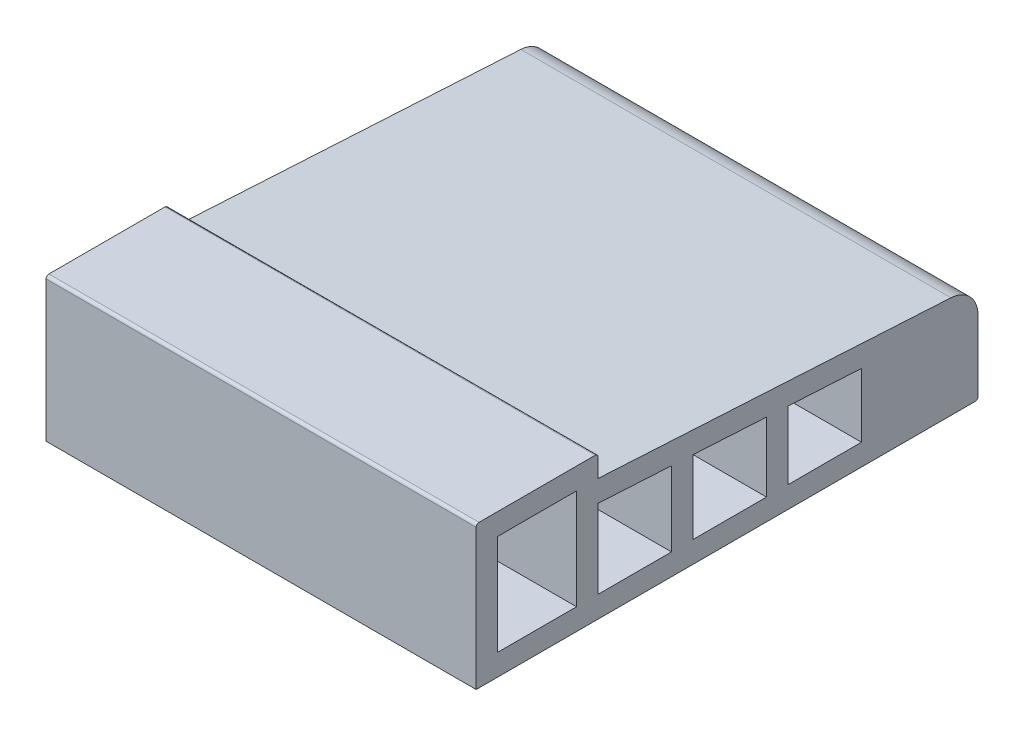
from build123d import *

# Parameters (mm, degrees)
ESQUISSE1_W      = 5.5
ESQUISSE1_H      = 7
EXTRUSION1_DEPTH = 30
D_POUILLE1_ANGLE = 1


with BuildPart() as part:
    # Esquisse1 → Extrusion1 (new body)
    with BuildSketch(Plane(origin=(0, 0, 0), x_dir=(0, 0, -1), z_dir=(1, 0, 0))):
        with BuildLine():
            Line((8.5, 8.5), (33.113026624, 7.106809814))
            ThreePointArc((33.113026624, 7.106809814), (34.453625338, 6.483677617), (35, 5.110006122))
            Line((35, 5.110006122), (35, 0.2))
            ThreePointArc((35, 0.2), (34.941421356, 0.058578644), (34.8, 0))
            Line((34.8, 0), (0, 0))
            Line((0, 0), (0, 9.8))
            ThreePointArc((0, 9.8), (0.058578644, 9.941421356), (0.2, 10))
            Line((0.2, 10), (8.3, 10))
            ThreePointArc((8.3, 10), (8.441421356, 9.941421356), (8.5, 9.8))
            Line((8.5, 9.8), (8.5, 8.5))
        make_face()
        with Locations((4.25, 5)):
            Rectangle(ESQUISSE1_W, ESQUISSE1_H, mode=Mode.SUBTRACT)
        Polygon((21.75, 1.5), (21.75, 6.247598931), (26.875, 5.957504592), (26.875, 1.5), align=None, mode=Mode.SUBTRACT)
        Polygon((8.5, 1.5), (13.625, 1.5), (13.625, 6.707504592), (8.5, 6.997598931), align=None, mode=Mode.SUBTRACT)
        Polygon((15.125, 1.5), (20.25, 1.5), (20.25, 6.332504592), (15.125, 6.622598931), align=None, mode=Mode.SUBTRACT)
    extrude(amount=EXTRUSION1_DEPTH)

    # D_pouille1
    d_pouille1_faces = [part.faces().sort_by_distance(p)[0] for p in [
        (15, 3.728752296, -26.875),
        (15, 1.5, -24.3125),
        (15, 3.916252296, -20.25),
        (15, 1.5, -17.6875),
        (15, 4.103752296, -13.625),
        (15, 1.5, -11.0625),
        (15, 5, -7),
        (15, 1.5, -4.25),
        (15, 6.102551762, -24.3125),
        (15, 3.873799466, -21.75),
        (15, 6.477551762, -17.6875),
        (15, 4.061299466, -15.125),
        (15, 6.852551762, -11.0625),
        (15, 4.248799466, -8.5),
        (15, 8.5, -4.25),
        (15, 5, -1.5),
    ]]
    draft(d_pouille1_faces, Plane(origin=(30, 9.8, -8.3), x_dir=(0, 0, 1), z_dir=(1, 0, 0)), D_POUILLE1_ANGLE)


solid = part.part
